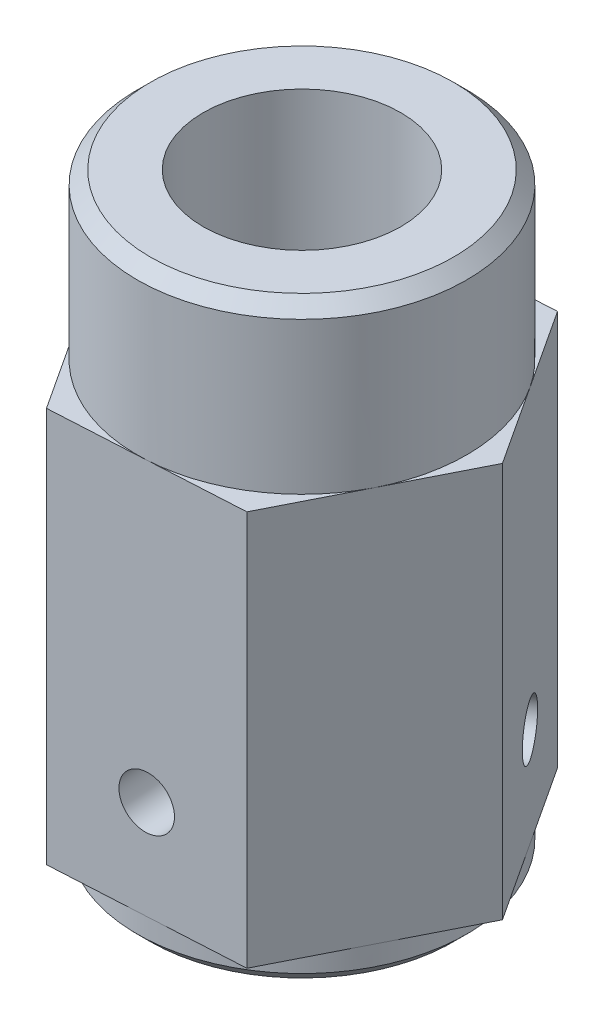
from build123d import *

# Parameters (mm, degrees)
EXTRUDE_1_DEPTH     = 60
SKETCH_2_R          = 25
EXTRUDE_2_DEPTH     = 25
EXTRUDE_START       = 5
SKETCH_3_R          = 25
EXTRUDE_3_DEPTH     = 5
SKETCH_4_R          = 12.5
CUT_EXTRUDE_1_DEPTH = 45
SKETCH_5_R          = 15
CUT_EXTRUDE_2_DEPTH = 45
SKETCH_6_R          = 4
CUT_EXTRUDE_3_DEPTH = 17
SKETCH_7_R          = 4
CUT_EXTRUDE_4_DEPTH = 17
SKETCH_8_R          = 4
CUT_EXTRUDE_5_DEPTH = 17
CHAMFER_1_SIZE      = 2


with BuildPart() as part:
    # Sketch 1 → Extrude 1 (new body)
    with BuildSketch(Plane(origin=(0, 0, 0), x_dir=(1, 0, 0), z_dir=(0, 1, 0))):
        Polygon((-13.023064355, -25.763018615), (15.799896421, -24.159813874), (28.822960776, 1.603204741), (13.023064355, 25.763018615), (-15.799896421, 24.159813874), (-28.822960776, -1.603204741), align=None)
    extrude(amount=EXTRUDE_1_DEPTH)

    # Sketch 2 → Extrude 2 (add)
    with BuildSketch(Plane(origin=(0, 60, 0), x_dir=(1, 0, 0), z_dir=(0, 1, 0))):
        with Locations(Location((0, 0, 0), (0, 0, 93.183653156))):
            Circle(SKETCH_2_R)
    extrude(amount=EXTRUDE_2_DEPTH)

    # Sketch 3 → Extrude 3 (add)
    with BuildSketch(Plane.XZ.offset(EXTRUDE_START)):
        with Locations(Location((0, 0, 0), (0, 0, 266.816346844))):
            Circle(SKETCH_3_R)
    extrude(amount=-EXTRUDE_3_DEPTH)

    # Sketch 4 → Cut-Extrude 1 (cut)
    with BuildSketch(Plane.XZ.offset(5)):
        with Locations(Location((0, 0, 0), (0, 0, 270))):
            Circle(SKETCH_4_R)
    extrude(amount=-CUT_EXTRUDE_1_DEPTH, mode=Mode.SUBTRACT)

    # Sketch 5 → Cut-Extrude 2 (cut)
    with BuildSketch(Plane(origin=(0, 85, 0), x_dir=(1, 0, 0), z_dir=(0, 1, 0))):
        with Locations(Location((0, 0, 0), (0, 0, 270))):
            Circle(SKETCH_5_R)
    extrude(amount=-CUT_EXTRUDE_2_DEPTH, mode=Mode.SUBTRACT)

    # Sketch 6 → Cut-Extrude 3 (cut)
    with BuildSketch(Plane(origin=(-22.311428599, 0, -11.278304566), x_dir=(-0.4511321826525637, 0, 0.892457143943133), z_dir=(-0.892457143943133, 0, -0.4511321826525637))):
        with Locations((0, 15)):
            Circle(SKETCH_6_R)
    extrude(amount=-CUT_EXTRUDE_3_DEPTH, mode=Mode.SUBTRACT)

    # Sketch 7 → Cut-Extrude 4 (cut)
    with BuildSketch(Plane(origin=(20.923012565, 0, -13.683111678), x_dir=(-0.5473244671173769, 0, -0.836920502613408), z_dir=(0.8369205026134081, 0, -0.5473244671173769))):
        with Locations((0, 15)):
            Circle(SKETCH_7_R)
    extrude(amount=-CUT_EXTRUDE_4_DEPTH, mode=Mode.SUBTRACT)

    # Sketch 8 → Cut-Extrude 5 (cut)
    with BuildSketch(Plane(origin=(1.388416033, 0, 24.961416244), x_dir=(0.9984566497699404, 0, -0.05553664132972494), z_dir=(0.05553664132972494, 0, 0.9984566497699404))):
        with Locations((0, 15)):
            Circle(SKETCH_8_R)
    extrude(amount=-CUT_EXTRUDE_5_DEPTH, mode=Mode.SUBTRACT)

    # Chamfer 1
    chamfer_1_edges = [part.edges().sort_by_distance(p)[0] for p in [
        (1.388416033, 85, 24.961416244),
        (1.388416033, -5, 24.961416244),
    ]]
    chamfer(chamfer_1_edges, length=CHAMFER_1_SIZE)


solid = part.part
